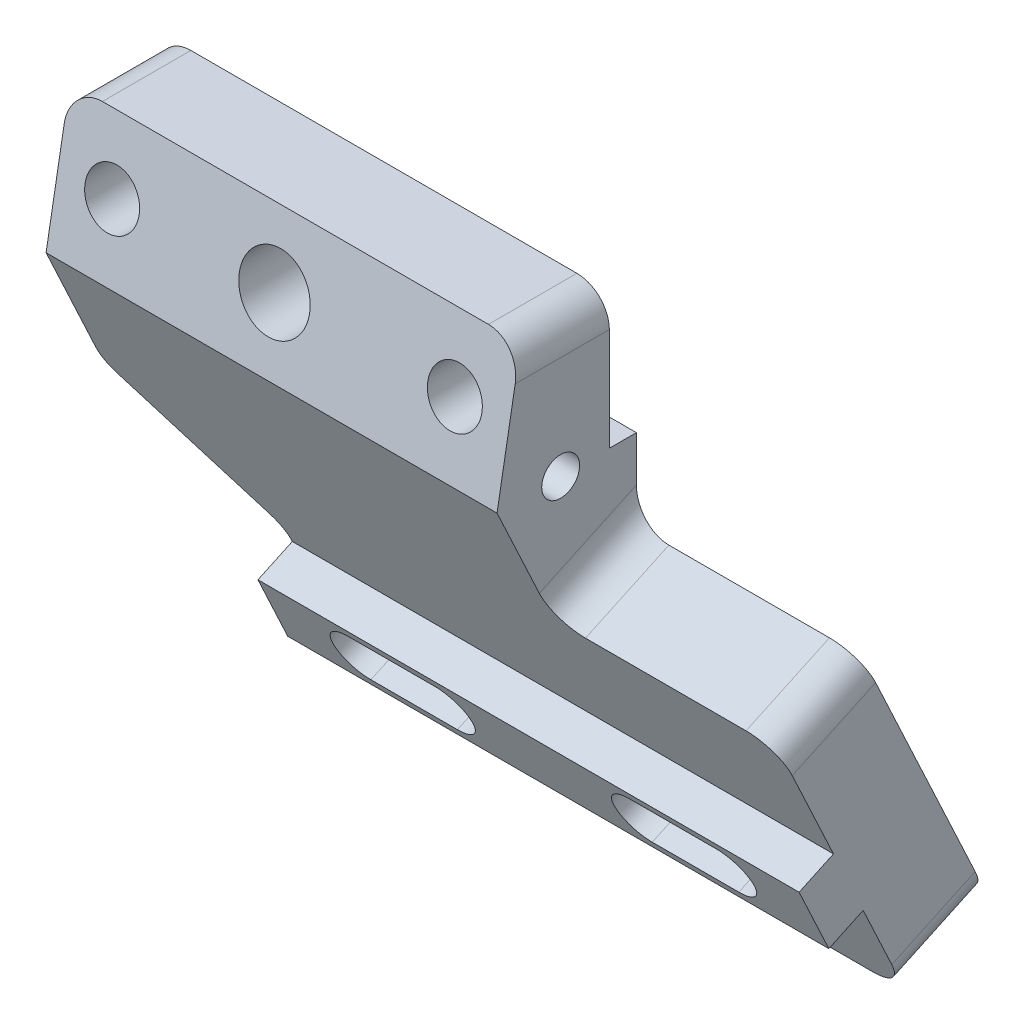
from build123d import *

# Parameters (mm, degrees)
EXTRUDE5_DEPTH     = 125
CUT_EXTRUDE1_DEPTH = 17
CUT_EXTRUDE2_DEPTH = 41.666666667
FILLET1_R          = 6
SKETCH15_R         = 3.5
CUT_EXTRUDE3_DEPTH = 150.0575839
SKETCH16_R         = 6.5
SKETCH16_R_2       = 5
CUT_EXTRUDE4_DEPTH = 149.291889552
SKETCH18_W         = 100
SKETCH18_H         = 13
EXTRUDE6_DEPTH     = 7
CUT_EXTRUDE5_DEPTH = 150.07074796


with BuildPart() as part:
    # Sketch10 → Extrude5 (new body)
    with BuildSketch(Plane(origin=(0, 0, 0), x_dir=(0, 0, -1), z_dir=(1, 0, 0))):
        Polygon((3.752039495, -2.028913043), (3.752039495, 22.971086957), (-12.591825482, 22.971086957), (-17, -2.028913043), (16.809460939, -74.533536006), (32.216693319, -67.349025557), (8.752039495, -17.028913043), (8.752039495, -2.028913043), align=None)
    extrude(amount=EXTRUDE5_DEPTH)

    # Sketch11 → Cut-Extrude1 (cut)
    with BuildSketch(Plane(origin=(0, 0.310756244, -0.666418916), x_dir=(-1, 0, 0), z_dir=(0, 0.4226182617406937, -0.9063077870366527))):
        Polygon((0, -19.132208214), (-25, -40.109698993), (-25, -74.654309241), (0, -74.654309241), align=None)
    extrude(amount=-CUT_EXTRUDE1_DEPTH, mode=Mode.SUBTRACT)

    # Sketch13 → Cut-Extrude2 (cut)
    with BuildSketch(Plane(origin=(125, 0, 0), x_dir=(0, 0, -1), z_dir=(1, 0, 0))):
        Polygon((8.752039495, -17.028913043), (-6.655192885, -24.213423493), (-17, -2.028913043), (-12.591825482, 22.971086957), (3.752039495, 22.971086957), (3.752039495, -2.028913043), (8.752039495, -2.028913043), align=None)
    extrude(amount=-CUT_EXTRUDE2_DEPTH, mode=Mode.SUBTRACT)

    # Fillet1
    fillet1_edges = [part.edges().sort_by_distance(p)[0] for p in [
        (125, -70.941280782, -24.513077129),
        (0, -20.621168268, -1.048423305),
        (25, -70.941280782, -24.513077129),
        (25, -39.633231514, -9.913893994),
        (83.333333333, -20.621168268, -1.048423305),
        (83.333333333, 22.971086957, 4.419892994),
        (125, -20.621168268, -1.048423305),
        (0, 22.971086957, 4.419892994),
    ]]
    fillet(fillet1_edges, radius=FILLET1_R)

    # Sketch15 → Cut-Extrude3 (cut, through all)
    with BuildSketch(Plane.ZY):
        with Locations((5.247960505, -2.028913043)):
            Circle(SKETCH15_R)
    extrude(amount=-CUT_EXTRUDE3_DEPTH, mode=Mode.SUBTRACT)

    # Sketch16 → Cut-Extrude4 (cut, through all)
    with BuildSketch(Plane(origin=(0, 0, -3.752039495), x_dir=(-1, 0, 0), z_dir=(0, 0, -1))):
        with Locations((-40, 10.471086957)):
            Circle(SKETCH16_R)
        with Locations((-10, 10.471086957)):
            Circle(SKETCH16_R_2)
        with Locations((-73.333333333, 10.471086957)):
            Circle(SKETCH16_R_2)
    extrude(amount=-CUT_EXTRUDE4_DEPTH, mode=Mode.SUBTRACT)

    # Sketch18 → Extrude6 (add)
    with BuildSketch(Plane(origin=(0, -6.873754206, 14.740813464), x_dir=(1, 0, 0), z_dir=(0, -0.4226182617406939, 0.9063077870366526))):
        with Locations((75, -49.654309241)):
            Rectangle(SKETCH18_W, SKETCH18_H)
    extrude(amount=EXTRUDE6_DEPTH)

    # Sketch17 → Cut-Extrude5 (cut, through all)
    with BuildSketch(Plane(origin=(0, 0.310756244, -0.666418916), x_dir=(-1, 0, 0), z_dir=(0, 0.422618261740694, -0.9063077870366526))):
        with BuildLine():
            Line((-109, -54.654309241), (-93, -54.654309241))
            ThreePointArc((-93, -54.654309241), (-88, -49.654309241), (-93, -44.654309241))
            Line((-93, -44.654309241), (-109, -44.654309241))
            ThreePointArc((-109, -44.654309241), (-114, -49.654309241), (-109, -54.654309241))
        make_face()
        with BuildLine():
            Line((-57, -54.654309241), (-41, -54.654309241))
            ThreePointArc((-41, -54.654309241), (-36, -49.654309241), (-41, -44.654309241))
            Line((-41, -44.654309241), (-57, -44.654309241))
            ThreePointArc((-57, -44.654309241), (-62, -49.654309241), (-57, -54.654309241))
        make_face()
    extrude(amount=-CUT_EXTRUDE5_DEPTH, mode=Mode.SUBTRACT)


solid = part.part
